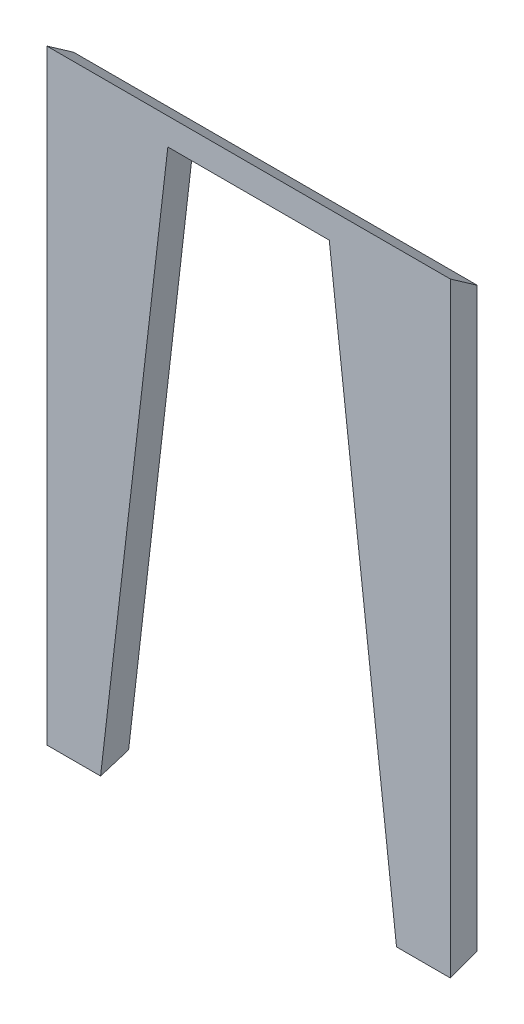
ISO-10303-21;
HEADER;
FILE_DESCRIPTION(('STEP AP214'),'2;1');
FILE_NAME('part.step','',(''),(''),'','','');
FILE_SCHEMA(('AUTOMOTIVE_DESIGN { 1 0 10303 214 1 1 1 1 }'));
ENDSEC;
DATA;
#1=APPLICATION_CONTEXT('core data for automotive mechanical design processes');
#2=APPLICATION_PROTOCOL_DEFINITION('international standard','automotive_design',2000,#1);
#3=PRODUCT_CONTEXT('',#1,'mechanical');
#4=PRODUCT('Part','Part','',(#3));
#5=PRODUCT_RELATED_PRODUCT_CATEGORY('part','',(#4));
#6=PRODUCT_DEFINITION_FORMATION('','',#4);
#7=PRODUCT_DEFINITION_CONTEXT('part definition',#1,'design');
#8=PRODUCT_DEFINITION('design','',#6,#7);
#9=PRODUCT_DEFINITION_SHAPE('','',#8);
#10=(LENGTH_UNIT() NAMED_UNIT(*) SI_UNIT(.MILLI.,.METRE.));
#11=(NAMED_UNIT(*) PLANE_ANGLE_UNIT() SI_UNIT($,.RADIAN.));
#12=(NAMED_UNIT(*) SI_UNIT($,.STERADIAN.) SOLID_ANGLE_UNIT());
#13=UNCERTAINTY_MEASURE_WITH_UNIT(LENGTH_MEASURE(1.E-05),#10,'distance_accuracy_value','');
#14=(GEOMETRIC_REPRESENTATION_CONTEXT(3) GLOBAL_UNCERTAINTY_ASSIGNED_CONTEXT((#13)) GLOBAL_UNIT_ASSIGNED_CONTEXT((#10,
#11,#12)) REPRESENTATION_CONTEXT('',''));
#15=CARTESIAN_POINT('',(0.,0.,0.));
#16=DIRECTION('',(0.,0.,1.));
#17=DIRECTION('',(1.,0.,0.));
#18=AXIS2_PLACEMENT_3D('',#15,#16,#17);
#19=CARTESIAN_POINT('',(0.,-450.,10.));
#20=DIRECTION('',(1.,0.,0.));
#21=DIRECTION('',(0.,0.,-1.));
#22=AXIS2_PLACEMENT_3D('',#19,#20,#21);
#23=PLANE('',#22);
#24=DIRECTION('',(0.,-1.,0.));
#25=VECTOR('',#24,1.);
#26=CARTESIAN_POINT('',(0.,-450.,-10.));
#27=LINE('',#26,#25);
#28=CARTESIAN_POINT('',(-1.11022302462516E-13,-14.0041507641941,-10.));
#29=VERTEX_POINT('',#28);
#30=CARTESIAN_POINT('',(0.,-442.720595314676,-10.));
#31=VERTEX_POINT('',#30);
#32=EDGE_CURVE('E108',#29,#31,#27,.T.);
#33=ORIENTED_EDGE('',*,*,#32,.T.);
#34=DIRECTION('',(0.,-0.342020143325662,0.939692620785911));
#35=VECTOR('',#34,1.);
#36=CARTESIAN_POINT('',(0.,-450.,10.));
#37=LINE('',#36,#35);
#38=CARTESIAN_POINT('',(0.,-450.,10.));
#39=VERTEX_POINT('',#38);
#40=EDGE_CURVE('E46',#31,#39,#37,.T.);
#41=ORIENTED_EDGE('',*,*,#40,.T.);
#42=DIRECTION('',(0.,-1.,0.));
#43=VECTOR('',#42,1.);
#44=CARTESIAN_POINT('',(0.,-450.,10.));
#45=LINE('',#44,#43);
#46=CARTESIAN_POINT('',(-1.11022302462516E-13,0.,10.));
#47=VERTEX_POINT('',#46);
#48=EDGE_CURVE('E101',#47,#39,#45,.T.);
#49=ORIENTED_EDGE('',*,*,#48,.F.);
#50=DIRECTION('',(0.,-0.573576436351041,-0.819152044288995));
#51=VECTOR('',#50,1.);
#52=CARTESIAN_POINT('',(-1.11022302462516E-13,0.,10.));
#53=LINE('',#52,#51);
#54=EDGE_CURVE('E166',#47,#29,#53,.T.);
#55=ORIENTED_EDGE('',*,*,#54,.T.);
#56=EDGE_LOOP('',(#33,#41,#49,#55));
#57=FACE_BOUND('',#56,.T.);
#58=ADVANCED_FACE('F32',(#57),#23,.F.);
#59=CARTESIAN_POINT('',(90.,-20.,10.));
#60=DIRECTION('',(-0.993307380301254,0.115500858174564,0.));
#61=DIRECTION('',(-0.115500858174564,-0.993307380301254,0.));
#62=AXIS2_PLACEMENT_3D('',#59,#60,#61);
#63=PLANE('',#62);
#64=DIRECTION('',(0.115500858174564,0.993307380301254,0.));
#65=VECTOR('',#64,1.);
#66=CARTESIAN_POINT('',(90.,-20.,10.));
#67=LINE('',#66,#65);
#68=CARTESIAN_POINT('',(40.,-450.,10.));
#69=VERTEX_POINT('',#68);
#70=CARTESIAN_POINT('',(90.,-20.,10.));
#71=VERTEX_POINT('',#70);
#72=EDGE_CURVE('E100',#69,#71,#67,.T.);
#73=ORIENTED_EDGE('',*,*,#72,.F.);
#74=DIRECTION('',(0.039738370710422,0.34174998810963,-0.938950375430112));
#75=VECTOR('',#74,1.);
#76=CARTESIAN_POINT('',(45.9186096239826,-399.09995723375,-129.846718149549));
#77=LINE('',#76,#75);
#78=CARTESIAN_POINT('',(40.8464424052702,-442.720595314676,-10.));
#79=VERTEX_POINT('',#78);
#80=EDGE_CURVE('E96',#69,#79,#77,.T.);
#81=ORIENTED_EDGE('',*,*,#80,.T.);
#82=DIRECTION('',(0.115500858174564,0.993307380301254,0.));
#83=VECTOR('',#82,1.);
#84=CARTESIAN_POINT('',(90.,-20.,-10.));
#85=LINE('',#84,#83);
#86=CARTESIAN_POINT('',(90.,-20.,-10.));
#87=VERTEX_POINT('',#86);
#88=EDGE_CURVE('E138',#79,#87,#85,.T.);
#89=ORIENTED_EDGE('',*,*,#88,.T.);
#90=DIRECTION('',(0.,0.,-1.));
#91=VECTOR('',#90,1.);
#92=CARTESIAN_POINT('',(90.,-20.,10.));
#93=LINE('',#92,#91);
#94=EDGE_CURVE('E39',#71,#87,#93,.T.);
#95=ORIENTED_EDGE('',*,*,#94,.F.);
#96=EDGE_LOOP('',(#73,#81,#89,#95));
#97=FACE_BOUND('',#96,.T.);
#98=ADVANCED_FACE('F162',(#97),#63,.F.);
#99=CARTESIAN_POINT('',(210.,-20.,10.));
#100=DIRECTION('',(0.,1.,0.));
#101=DIRECTION('',(-1.,0.,0.));
#102=AXIS2_PLACEMENT_3D('',#99,#100,#101);
#103=PLANE('',#102);
#104=DIRECTION('',(1.,0.,0.));
#105=VECTOR('',#104,1.);
#106=CARTESIAN_POINT('',(210.,-20.,-10.));
#107=LINE('',#106,#105);
#108=CARTESIAN_POINT('',(210.,-20.,-10.));
#109=VERTEX_POINT('',#108);
#110=EDGE_CURVE('E140',#87,#109,#107,.T.);
#111=ORIENTED_EDGE('',*,*,#110,.T.);
#112=DIRECTION('',(0.,0.,-1.));
#113=VECTOR('',#112,1.);
#114=CARTESIAN_POINT('',(210.,-20.,10.));
#115=LINE('',#114,#113);
#116=CARTESIAN_POINT('',(210.,-20.,10.));
#117=VERTEX_POINT('',#116);
#118=EDGE_CURVE('E136',#117,#109,#115,.T.);
#119=ORIENTED_EDGE('',*,*,#118,.F.);
#120=DIRECTION('',(1.,0.,0.));
#121=VECTOR('',#120,1.);
#122=CARTESIAN_POINT('',(210.,-20.,10.));
#123=LINE('',#122,#121);
#124=EDGE_CURVE('E125',#71,#117,#123,.T.);
#125=ORIENTED_EDGE('',*,*,#124,.F.);
#126=ORIENTED_EDGE('',*,*,#94,.T.);
#127=EDGE_LOOP('',(#111,#119,#125,#126));
#128=FACE_BOUND('',#127,.T.);
#129=ADVANCED_FACE('F150',(#128),#103,.F.);
#130=CARTESIAN_POINT('',(260.,-450.,10.));
#131=DIRECTION('',(0.993307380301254,0.115500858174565,0.));
#132=DIRECTION('',(-0.115500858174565,0.993307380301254,0.));
#133=AXIS2_PLACEMENT_3D('',#130,#131,#132);
#134=PLANE('',#133);
#135=DIRECTION('',(0.115500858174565,-0.993307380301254,0.));
#136=VECTOR('',#135,1.);
#137=CARTESIAN_POINT('',(260.,-450.,-10.));
#138=LINE('',#137,#136);
#139=CARTESIAN_POINT('',(259.15355759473,-442.720595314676,-10.));
#140=VERTEX_POINT('',#139);
#141=EDGE_CURVE('E118',#109,#140,#138,.T.);
#142=ORIENTED_EDGE('',*,*,#141,.T.);
#143=DIRECTION('',(0.0397383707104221,-0.34174998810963,0.938950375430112));
#144=VECTOR('',#143,1.);
#145=CARTESIAN_POINT('',(260.,-450.,10.));
#146=LINE('',#145,#144);
#147=CARTESIAN_POINT('',(260.,-450.,10.));
#148=VERTEX_POINT('',#147);
#149=EDGE_CURVE('E53',#140,#148,#146,.T.);
#150=ORIENTED_EDGE('',*,*,#149,.T.);
#151=DIRECTION('',(0.115500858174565,-0.993307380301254,0.));
#152=VECTOR('',#151,1.);
#153=CARTESIAN_POINT('',(260.,-450.,10.));
#154=LINE('',#153,#152);
#155=EDGE_CURVE('E127',#117,#148,#154,.T.);
#156=ORIENTED_EDGE('',*,*,#155,.F.);
#157=ORIENTED_EDGE('',*,*,#118,.T.);
#158=EDGE_LOOP('',(#142,#150,#156,#157));
#159=FACE_BOUND('',#158,.T.);
#160=ADVANCED_FACE('F159',(#159),#134,.F.);
#161=CARTESIAN_POINT('',(300.,0.,10.));
#162=DIRECTION('',(-1.,0.,0.));
#163=DIRECTION('',(0.,-1.,0.));
#164=AXIS2_PLACEMENT_3D('',#161,#162,#163);
#165=PLANE('',#164);
#166=DIRECTION('',(0.,1.,0.));
#167=VECTOR('',#166,1.);
#168=CARTESIAN_POINT('',(300.,0.,10.));
#169=LINE('',#168,#167);
#170=CARTESIAN_POINT('',(300.,-450.,10.));
#171=VERTEX_POINT('',#170);
#172=CARTESIAN_POINT('',(300.,0.,10.));
#173=VERTEX_POINT('',#172);
#174=EDGE_CURVE('E133',#171,#173,#169,.T.);
#175=ORIENTED_EDGE('',*,*,#174,.F.);
#176=DIRECTION('',(0.,-0.342020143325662,0.939692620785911));
#177=VECTOR('',#176,1.);
#178=CARTESIAN_POINT('',(300.,-450.,10.));
#179=LINE('',#178,#177);
#180=CARTESIAN_POINT('',(300.,-442.720595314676,-10.));
#181=VERTEX_POINT('',#180);
#182=EDGE_CURVE('E110',#181,#171,#179,.T.);
#183=ORIENTED_EDGE('',*,*,#182,.F.);
#184=DIRECTION('',(0.,1.,0.));
#185=VECTOR('',#184,1.);
#186=CARTESIAN_POINT('',(300.,0.,-10.));
#187=LINE('',#186,#185);
#188=CARTESIAN_POINT('',(300.,-14.004150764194,-10.));
#189=VERTEX_POINT('',#188);
#190=EDGE_CURVE('E116',#181,#189,#187,.T.);
#191=ORIENTED_EDGE('',*,*,#190,.T.);
#192=DIRECTION('',(0.,-0.573576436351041,-0.819152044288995));
#193=VECTOR('',#192,1.);
#194=CARTESIAN_POINT('',(300.,0.,10.));
#195=LINE('',#194,#193);
#196=EDGE_CURVE('E163',#173,#189,#195,.T.);
#197=ORIENTED_EDGE('',*,*,#196,.F.);
#198=EDGE_LOOP('',(#175,#183,#191,#197));
#199=FACE_BOUND('',#198,.T.);
#200=ADVANCED_FACE('F175',(#199),#165,.F.);
#201=CARTESIAN_POINT('',(0.,0.,10.));
#202=DIRECTION('',(0.,0.,-1.));
#203=DIRECTION('',(-1.,0.,0.));
#204=AXIS2_PLACEMENT_3D('',#201,#202,#203);
#205=PLANE('',#204);
#206=ORIENTED_EDGE('',*,*,#48,.T.);
#207=DIRECTION('',(1.,0.,0.));
#208=VECTOR('',#207,1.);
#209=CARTESIAN_POINT('',(40.,-450.,10.));
#210=LINE('',#209,#208);
#211=EDGE_CURVE('E93',#39,#69,#210,.T.);
#212=ORIENTED_EDGE('',*,*,#211,.T.);
#213=ORIENTED_EDGE('',*,*,#72,.T.);
#214=ORIENTED_EDGE('',*,*,#124,.T.);
#215=ORIENTED_EDGE('',*,*,#155,.T.);
#216=DIRECTION('',(1.,0.,0.));
#217=VECTOR('',#216,1.);
#218=CARTESIAN_POINT('',(300.,-450.,10.));
#219=LINE('',#218,#217);
#220=EDGE_CURVE('E130',#148,#171,#219,.T.);
#221=ORIENTED_EDGE('',*,*,#220,.T.);
#222=ORIENTED_EDGE('',*,*,#174,.T.);
#223=DIRECTION('',(-1.,0.,0.));
#224=VECTOR('',#223,1.);
#225=CARTESIAN_POINT('',(0.,0.,10.));
#226=LINE('',#225,#224);
#227=EDGE_CURVE('E115',#173,#47,#226,.T.);
#228=ORIENTED_EDGE('',*,*,#227,.T.);
#229=EDGE_LOOP('',(#206,#212,#213,#214,#215,#221,#222,#228));
#230=FACE_BOUND('',#229,.T.);
#231=ADVANCED_FACE('F113',(#230),#205,.F.);
#232=CARTESIAN_POINT('',(0.,0.,-10.));
#233=DIRECTION('',(0.,0.,-1.));
#234=DIRECTION('',(-1.,0.,0.));
#235=AXIS2_PLACEMENT_3D('',#232,#233,#234);
#236=PLANE('',#235);
#237=DIRECTION('',(1.,0.,0.));
#238=VECTOR('',#237,1.);
#239=CARTESIAN_POINT('',(0.,-442.720595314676,-10.));
#240=LINE('',#239,#238);
#241=EDGE_CURVE('E109',#31,#79,#240,.T.);
#242=ORIENTED_EDGE('',*,*,#241,.F.);
#243=ORIENTED_EDGE('',*,*,#32,.F.);
#244=DIRECTION('',(1.,0.,0.));
#245=VECTOR('',#244,1.);
#246=CARTESIAN_POINT('',(-1.11022302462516E-13,-14.0041507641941,-10.));
#247=LINE('',#246,#245);
#248=EDGE_CURVE('E121',#29,#189,#247,.T.);
#249=ORIENTED_EDGE('',*,*,#248,.T.);
#250=ORIENTED_EDGE('',*,*,#190,.F.);
#251=DIRECTION('',(1.,0.,0.));
#252=VECTOR('',#251,1.);
#253=CARTESIAN_POINT('',(1.09226355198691E-13,-442.720595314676,-10.));
#254=LINE('',#253,#252);
#255=EDGE_CURVE('E11',#140,#181,#254,.T.);
#256=ORIENTED_EDGE('',*,*,#255,.F.);
#257=ORIENTED_EDGE('',*,*,#141,.F.);
#258=ORIENTED_EDGE('',*,*,#110,.F.);
#259=ORIENTED_EDGE('',*,*,#88,.F.);
#260=EDGE_LOOP('',(#242,#243,#249,#250,#256,#257,#258,#259));
#261=FACE_BOUND('',#260,.T.);
#262=ADVANCED_FACE('F156',(#261),#236,.T.);
#263=CARTESIAN_POINT('',(-1.11022302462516E-13,0.,10.));
#264=DIRECTION('',(0.,-0.819152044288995,0.573576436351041));
#265=DIRECTION('',(0.,-0.573576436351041,-0.819152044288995));
#266=AXIS2_PLACEMENT_3D('',#263,#264,#265);
#267=PLANE('',#266);
#268=ORIENTED_EDGE('',*,*,#196,.T.);
#269=ORIENTED_EDGE('',*,*,#248,.F.);
#270=ORIENTED_EDGE('',*,*,#54,.F.);
#271=ORIENTED_EDGE('',*,*,#227,.F.);
#272=EDGE_LOOP('',(#268,#269,#270,#271));
#273=FACE_BOUND('',#272,.T.);
#274=ADVANCED_FACE('F172',(#273),#267,.F.);
#275=CARTESIAN_POINT('',(0.,-450.,10.));
#276=DIRECTION('',(0.,0.939692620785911,0.342020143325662));
#277=DIRECTION('',(0.,-0.342020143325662,0.939692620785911));
#278=AXIS2_PLACEMENT_3D('',#275,#276,#277);
#279=PLANE('',#278);
#280=ORIENTED_EDGE('',*,*,#255,.T.);
#281=ORIENTED_EDGE('',*,*,#182,.T.);
#282=ORIENTED_EDGE('',*,*,#220,.F.);
#283=ORIENTED_EDGE('',*,*,#149,.F.);
#284=EDGE_LOOP('',(#280,#281,#282,#283));
#285=FACE_BOUND('',#284,.T.);
#286=ADVANCED_FACE('F178',(#285),#279,.F.);
#287=ORIENTED_EDGE('',*,*,#211,.F.);
#288=ORIENTED_EDGE('',*,*,#40,.F.);
#289=ORIENTED_EDGE('',*,*,#241,.T.);
#290=ORIENTED_EDGE('',*,*,#80,.F.);
#291=EDGE_LOOP('',(#287,#288,#289,#290));
#292=FACE_BOUND('',#291,.T.);
#293=ADVANCED_FACE('F94',(#292),#279,.F.);
#294=CLOSED_SHELL('',(#58,#98,#129,#160,#200,#231,#262,#274,#286,#293));
#295=MANIFOLD_SOLID_BREP('B2',#294);
#296=ADVANCED_BREP_SHAPE_REPRESENTATION('',(#18,#295),#14);
#297=SHAPE_DEFINITION_REPRESENTATION(#9,#296);
ENDSEC;
END-ISO-10303-21;
